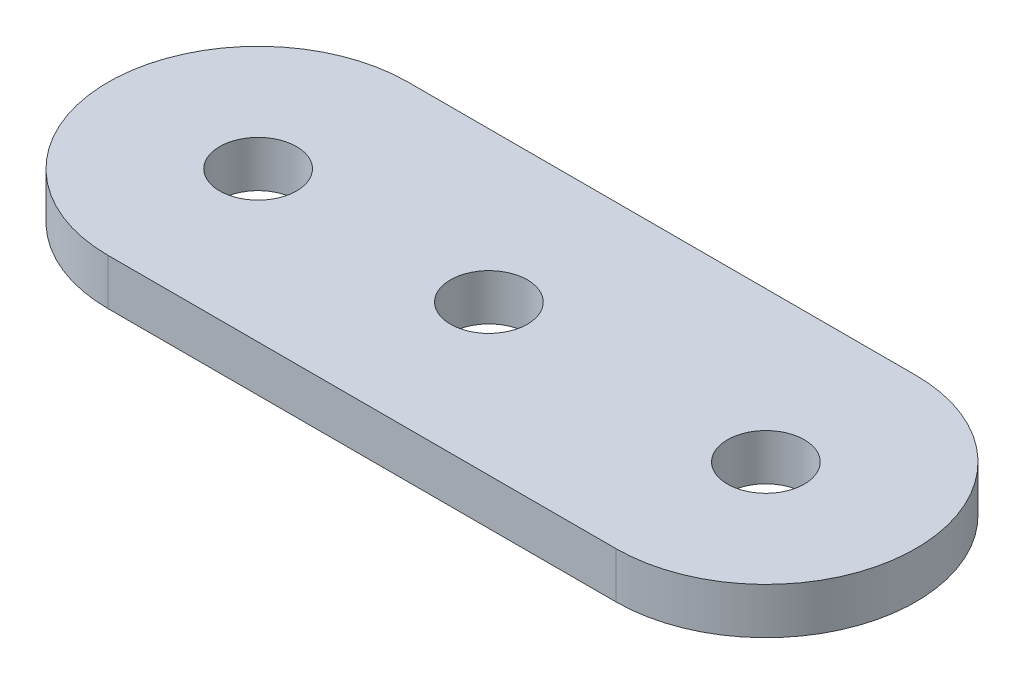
ISO-10303-21;
HEADER;
FILE_DESCRIPTION(('STEP AP214'),'2;1');
FILE_NAME('part.step','',(''),(''),'','','');
FILE_SCHEMA(('AUTOMOTIVE_DESIGN { 1 0 10303 214 1 1 1 1 }'));
ENDSEC;
DATA;
#1=APPLICATION_CONTEXT('core data for automotive mechanical design processes');
#2=APPLICATION_PROTOCOL_DEFINITION('international standard','automotive_design',2000,#1);
#3=PRODUCT_CONTEXT('',#1,'mechanical');
#4=PRODUCT('Part','Part','',(#3));
#5=PRODUCT_RELATED_PRODUCT_CATEGORY('part','',(#4));
#6=PRODUCT_DEFINITION_FORMATION('','',#4);
#7=PRODUCT_DEFINITION_CONTEXT('part definition',#1,'design');
#8=PRODUCT_DEFINITION('design','',#6,#7);
#9=PRODUCT_DEFINITION_SHAPE('','',#8);
#10=(LENGTH_UNIT() NAMED_UNIT(*) SI_UNIT(.MILLI.,.METRE.));
#11=(NAMED_UNIT(*) PLANE_ANGLE_UNIT() SI_UNIT($,.RADIAN.));
#12=(NAMED_UNIT(*) SI_UNIT($,.STERADIAN.) SOLID_ANGLE_UNIT());
#13=UNCERTAINTY_MEASURE_WITH_UNIT(LENGTH_MEASURE(1.E-05),#10,'distance_accuracy_value','');
#14=(GEOMETRIC_REPRESENTATION_CONTEXT(3) GLOBAL_UNCERTAINTY_ASSIGNED_CONTEXT((#13)) GLOBAL_UNIT_ASSIGNED_CONTEXT((#10,
#11,#12)) REPRESENTATION_CONTEXT('',''));
#15=CARTESIAN_POINT('',(0.,0.,0.));
#16=DIRECTION('',(0.,0.,1.));
#17=DIRECTION('',(1.,0.,0.));
#18=AXIS2_PLACEMENT_3D('',#15,#16,#17);
#19=CARTESIAN_POINT('',(-16.5,0.,0.));
#20=DIRECTION('',(0.,1.,0.));
#21=DIRECTION('',(0.,0.,1.));
#22=AXIS2_PLACEMENT_3D('',#19,#20,#21);
#23=PLANE('',#22);
#24=CARTESIAN_POINT('',(16.5,0.,0.));
#25=DIRECTION('',(0.,-1.,0.));
#26=DIRECTION('',(0.,0.,-1.));
#27=AXIS2_PLACEMENT_3D('',#24,#25,#26);
#28=CIRCLE('',#27,2.5);
#29=CARTESIAN_POINT('',(16.5,0.,-2.5));
#30=VERTEX_POINT('',#29);
#31=EDGE_CURVE('E94',#30,#30,#28,.F.);
#32=ORIENTED_EDGE('',*,*,#31,.T.);
#33=EDGE_LOOP('',(#32));
#34=FACE_BOUND('',#33,.T.);
#35=CARTESIAN_POINT('',(-1.5,0.,0.));
#36=DIRECTION('',(0.,-1.,0.));
#37=DIRECTION('',(0.,0.,-1.));
#38=AXIS2_PLACEMENT_3D('',#35,#36,#37);
#39=CIRCLE('',#38,2.5);
#40=CARTESIAN_POINT('',(-1.5,0.,-2.5));
#41=VERTEX_POINT('',#40);
#42=EDGE_CURVE('E73',#41,#41,#39,.F.);
#43=ORIENTED_EDGE('',*,*,#42,.T.);
#44=EDGE_LOOP('',(#43));
#45=FACE_BOUND('',#44,.T.);
#46=CARTESIAN_POINT('',(-16.5,0.,0.));
#47=DIRECTION('',(0.,-1.,0.));
#48=DIRECTION('',(0.,0.,-1.));
#49=AXIS2_PLACEMENT_3D('',#46,#47,#48);
#50=CIRCLE('',#49,2.5);
#51=CARTESIAN_POINT('',(-16.5,0.,-2.5));
#52=VERTEX_POINT('',#51);
#53=EDGE_CURVE('E76',#52,#52,#50,.F.);
#54=ORIENTED_EDGE('',*,*,#53,.T.);
#55=EDGE_LOOP('',(#54));
#56=FACE_BOUND('',#55,.T.);
#57=DIRECTION('',(1.,0.,0.));
#58=VECTOR('',#57,1.);
#59=CARTESIAN_POINT('',(-16.5,0.,-9.75));
#60=LINE('',#59,#58);
#61=CARTESIAN_POINT('',(-16.5,0.,-9.75));
#62=VERTEX_POINT('',#61);
#63=CARTESIAN_POINT('',(16.5,0.,-9.75));
#64=VERTEX_POINT('',#63);
#65=EDGE_CURVE('E58',#62,#64,#60,.T.);
#66=ORIENTED_EDGE('',*,*,#65,.T.);
#67=CARTESIAN_POINT('',(16.5,0.,0.));
#68=DIRECTION('',(0.,-1.,0.));
#69=DIRECTION('',(0.,0.,-1.));
#70=AXIS2_PLACEMENT_3D('',#67,#68,#69);
#71=CIRCLE('',#70,9.75);
#72=CARTESIAN_POINT('',(16.5,0.,9.75));
#73=VERTEX_POINT('',#72);
#74=EDGE_CURVE('E81',#73,#64,#71,.F.);
#75=ORIENTED_EDGE('',*,*,#74,.F.);
#76=DIRECTION('',(-1.,0.,0.));
#77=VECTOR('',#76,1.);
#78=CARTESIAN_POINT('',(-16.5,0.,9.75));
#79=LINE('',#78,#77);
#80=CARTESIAN_POINT('',(-16.5,0.,9.75));
#81=VERTEX_POINT('',#80);
#82=EDGE_CURVE('E60',#73,#81,#79,.T.);
#83=ORIENTED_EDGE('',*,*,#82,.T.);
#84=CARTESIAN_POINT('',(-16.5,0.,0.));
#85=DIRECTION('',(0.,-1.,0.));
#86=DIRECTION('',(0.,0.,-1.));
#87=AXIS2_PLACEMENT_3D('',#84,#85,#86);
#88=CIRCLE('',#87,9.75);
#89=EDGE_CURVE('E20',#62,#81,#88,.F.);
#90=ORIENTED_EDGE('',*,*,#89,.F.);
#91=EDGE_LOOP('',(#66,#75,#83,#90));
#92=FACE_BOUND('',#91,.T.);
#93=ADVANCED_FACE('F17',(#34,#45,#56,#92),#23,.F.);
#94=CARTESIAN_POINT('',(-16.5,3.,0.));
#95=DIRECTION('',(0.,-1.,0.));
#96=DIRECTION('',(0.,0.,-1.));
#97=AXIS2_PLACEMENT_3D('',#94,#95,#96);
#98=CYLINDRICAL_SURFACE('',#97,9.75);
#99=CARTESIAN_POINT('',(-16.5,3.,0.));
#100=DIRECTION('',(0.,-1.,0.));
#101=DIRECTION('',(0.,0.,-1.));
#102=AXIS2_PLACEMENT_3D('',#99,#100,#101);
#103=CIRCLE('',#102,9.75);
#104=CARTESIAN_POINT('',(-16.5,3.,-9.75));
#105=VERTEX_POINT('',#104);
#106=CARTESIAN_POINT('',(-16.5,3.,9.75));
#107=VERTEX_POINT('',#106);
#108=EDGE_CURVE('E68',#105,#107,#103,.F.);
#109=ORIENTED_EDGE('',*,*,#108,.F.);
#110=DIRECTION('',(0.,1.,0.));
#111=VECTOR('',#110,1.);
#112=CARTESIAN_POINT('',(-16.5,3.,-9.75));
#113=LINE('',#112,#111);
#114=EDGE_CURVE('E65',#105,#62,#113,.F.);
#115=ORIENTED_EDGE('',*,*,#114,.T.);
#116=ORIENTED_EDGE('',*,*,#89,.T.);
#117=DIRECTION('',(0.,1.,0.));
#118=VECTOR('',#117,1.);
#119=CARTESIAN_POINT('',(-16.5,3.,9.75));
#120=LINE('',#119,#118);
#121=EDGE_CURVE('E63',#81,#107,#120,.T.);
#122=ORIENTED_EDGE('',*,*,#121,.T.);
#123=EDGE_LOOP('',(#109,#115,#116,#122));
#124=FACE_BOUND('',#123,.T.);
#125=ADVANCED_FACE('F66',(#124),#98,.T.);
#126=CARTESIAN_POINT('',(-16.5,3.,9.75));
#127=DIRECTION('',(0.,0.,-1.));
#128=DIRECTION('',(-1.,0.,0.));
#129=AXIS2_PLACEMENT_3D('',#126,#127,#128);
#130=PLANE('',#129);
#131=DIRECTION('',(0.,-1.,0.));
#132=VECTOR('',#131,1.);
#133=CARTESIAN_POINT('',(16.5,3.,9.75));
#134=LINE('',#133,#132);
#135=CARTESIAN_POINT('',(16.5,3.,9.75));
#136=VERTEX_POINT('',#135);
#137=EDGE_CURVE('E98',#136,#73,#134,.T.);
#138=ORIENTED_EDGE('',*,*,#137,.F.);
#139=DIRECTION('',(1.,0.,0.));
#140=VECTOR('',#139,1.);
#141=CARTESIAN_POINT('',(-16.5,3.,9.75));
#142=LINE('',#141,#140);
#143=EDGE_CURVE('E92',#107,#136,#142,.T.);
#144=ORIENTED_EDGE('',*,*,#143,.F.);
#145=ORIENTED_EDGE('',*,*,#121,.F.);
#146=ORIENTED_EDGE('',*,*,#82,.F.);
#147=EDGE_LOOP('',(#138,#144,#145,#146));
#148=FACE_BOUND('',#147,.T.);
#149=ADVANCED_FACE('F109',(#148),#130,.F.);
#150=CARTESIAN_POINT('',(16.5,3.,0.));
#151=DIRECTION('',(0.,-1.,0.));
#152=DIRECTION('',(0.,0.,-1.));
#153=AXIS2_PLACEMENT_3D('',#150,#151,#152);
#154=CYLINDRICAL_SURFACE('',#153,9.75);
#155=CARTESIAN_POINT('',(16.5,3.,0.));
#156=DIRECTION('',(0.,-1.,0.));
#157=DIRECTION('',(0.,0.,-1.));
#158=AXIS2_PLACEMENT_3D('',#155,#156,#157);
#159=CIRCLE('',#158,9.75);
#160=CARTESIAN_POINT('',(16.5,3.,-9.75));
#161=VERTEX_POINT('',#160);
#162=EDGE_CURVE('E89',#136,#161,#159,.F.);
#163=ORIENTED_EDGE('',*,*,#162,.F.);
#164=ORIENTED_EDGE('',*,*,#137,.T.);
#165=ORIENTED_EDGE('',*,*,#74,.T.);
#166=DIRECTION('',(0.,1.,0.));
#167=VECTOR('',#166,1.);
#168=CARTESIAN_POINT('',(16.5,3.,-9.75));
#169=LINE('',#168,#167);
#170=EDGE_CURVE('E35',#64,#161,#169,.T.);
#171=ORIENTED_EDGE('',*,*,#170,.T.);
#172=EDGE_LOOP('',(#163,#164,#165,#171));
#173=FACE_BOUND('',#172,.T.);
#174=ADVANCED_FACE('F107',(#173),#154,.T.);
#175=CARTESIAN_POINT('',(-16.5,3.,-9.75));
#176=DIRECTION('',(0.,0.,1.));
#177=DIRECTION('',(1.,0.,0.));
#178=AXIS2_PLACEMENT_3D('',#175,#176,#177);
#179=PLANE('',#178);
#180=ORIENTED_EDGE('',*,*,#114,.F.);
#181=DIRECTION('',(1.,0.,0.));
#182=VECTOR('',#181,1.);
#183=CARTESIAN_POINT('',(-16.5,3.,-9.75));
#184=LINE('',#183,#182);
#185=EDGE_CURVE('E88',#161,#105,#184,.F.);
#186=ORIENTED_EDGE('',*,*,#185,.F.);
#187=ORIENTED_EDGE('',*,*,#170,.F.);
#188=ORIENTED_EDGE('',*,*,#65,.F.);
#189=EDGE_LOOP('',(#180,#186,#187,#188));
#190=FACE_BOUND('',#189,.T.);
#191=ADVANCED_FACE('F72',(#190),#179,.F.);
#192=CARTESIAN_POINT('',(-1.5,3.,0.));
#193=DIRECTION('',(0.,-1.,0.));
#194=DIRECTION('',(0.,0.,-1.));
#195=AXIS2_PLACEMENT_3D('',#192,#193,#194);
#196=CYLINDRICAL_SURFACE('',#195,2.5);
#197=CARTESIAN_POINT('',(-1.5,3.,0.));
#198=DIRECTION('',(0.,-1.,0.));
#199=DIRECTION('',(0.,0.,-1.));
#200=AXIS2_PLACEMENT_3D('',#197,#198,#199);
#201=CIRCLE('',#200,2.5);
#202=CARTESIAN_POINT('',(-1.5,3.,-2.5));
#203=VERTEX_POINT('',#202);
#204=EDGE_CURVE('E85',#203,#203,#201,.T.);
#205=ORIENTED_EDGE('',*,*,#204,.F.);
#206=EDGE_LOOP('',(#205));
#207=FACE_BOUND('',#206,.T.);
#208=ORIENTED_EDGE('',*,*,#42,.F.);
#209=EDGE_LOOP('',(#208));
#210=FACE_BOUND('',#209,.T.);
#211=ADVANCED_FACE('F116',(#207,#210),#196,.F.);
#212=CARTESIAN_POINT('',(-16.5,3.,0.));
#213=DIRECTION('',(0.,-1.,0.));
#214=DIRECTION('',(0.,0.,-1.));
#215=AXIS2_PLACEMENT_3D('',#212,#213,#214);
#216=CYLINDRICAL_SURFACE('',#215,2.5);
#217=CARTESIAN_POINT('',(-16.5,3.,0.));
#218=DIRECTION('',(0.,-1.,0.));
#219=DIRECTION('',(0.,0.,-1.));
#220=AXIS2_PLACEMENT_3D('',#217,#218,#219);
#221=CIRCLE('',#220,2.5);
#222=CARTESIAN_POINT('',(-16.5,3.,-2.5));
#223=VERTEX_POINT('',#222);
#224=EDGE_CURVE('E26',#223,#223,#221,.T.);
#225=ORIENTED_EDGE('',*,*,#224,.F.);
#226=EDGE_LOOP('',(#225));
#227=FACE_BOUND('',#226,.T.);
#228=ORIENTED_EDGE('',*,*,#53,.F.);
#229=EDGE_LOOP('',(#228));
#230=FACE_BOUND('',#229,.T.);
#231=ADVANCED_FACE('F127',(#227,#230),#216,.F.);
#232=CARTESIAN_POINT('',(16.5,3.,0.));
#233=DIRECTION('',(0.,-1.,0.));
#234=DIRECTION('',(0.,0.,-1.));
#235=AXIS2_PLACEMENT_3D('',#232,#233,#234);
#236=CYLINDRICAL_SURFACE('',#235,2.5);
#237=CARTESIAN_POINT('',(16.5,3.,0.));
#238=DIRECTION('',(0.,-1.,0.));
#239=DIRECTION('',(0.,0.,-1.));
#240=AXIS2_PLACEMENT_3D('',#237,#238,#239);
#241=CIRCLE('',#240,2.5);
#242=CARTESIAN_POINT('',(16.5,3.,-2.5));
#243=VERTEX_POINT('',#242);
#244=EDGE_CURVE('E11',#243,#243,#241,.T.);
#245=ORIENTED_EDGE('',*,*,#244,.F.);
#246=EDGE_LOOP('',(#245));
#247=FACE_BOUND('',#246,.T.);
#248=ORIENTED_EDGE('',*,*,#31,.F.);
#249=EDGE_LOOP('',(#248));
#250=FACE_BOUND('',#249,.T.);
#251=ADVANCED_FACE('F121',(#247,#250),#236,.F.);
#252=CARTESIAN_POINT('',(-16.5,3.,0.));
#253=DIRECTION('',(0.,1.,0.));
#254=DIRECTION('',(0.,0.,1.));
#255=AXIS2_PLACEMENT_3D('',#252,#253,#254);
#256=PLANE('',#255);
#257=ORIENTED_EDGE('',*,*,#244,.T.);
#258=EDGE_LOOP('',(#257));
#259=FACE_BOUND('',#258,.T.);
#260=ORIENTED_EDGE('',*,*,#224,.T.);
#261=EDGE_LOOP('',(#260));
#262=FACE_BOUND('',#261,.T.);
#263=ORIENTED_EDGE('',*,*,#204,.T.);
#264=EDGE_LOOP('',(#263));
#265=FACE_BOUND('',#264,.T.);
#266=ORIENTED_EDGE('',*,*,#162,.T.);
#267=ORIENTED_EDGE('',*,*,#185,.T.);
#268=ORIENTED_EDGE('',*,*,#108,.T.);
#269=ORIENTED_EDGE('',*,*,#143,.T.);
#270=EDGE_LOOP('',(#266,#267,#268,#269));
#271=FACE_BOUND('',#270,.T.);
#272=ADVANCED_FACE('F105',(#259,#262,#265,#271),#256,.T.);
#273=CLOSED_SHELL('',(#93,#125,#149,#174,#191,#211,#231,#251,#272));
#274=MANIFOLD_SOLID_BREP('B1',#273);
#275=ADVANCED_BREP_SHAPE_REPRESENTATION('',(#18,#274),#14);
#276=SHAPE_DEFINITION_REPRESENTATION(#9,#275);
ENDSEC;
END-ISO-10303-21;
